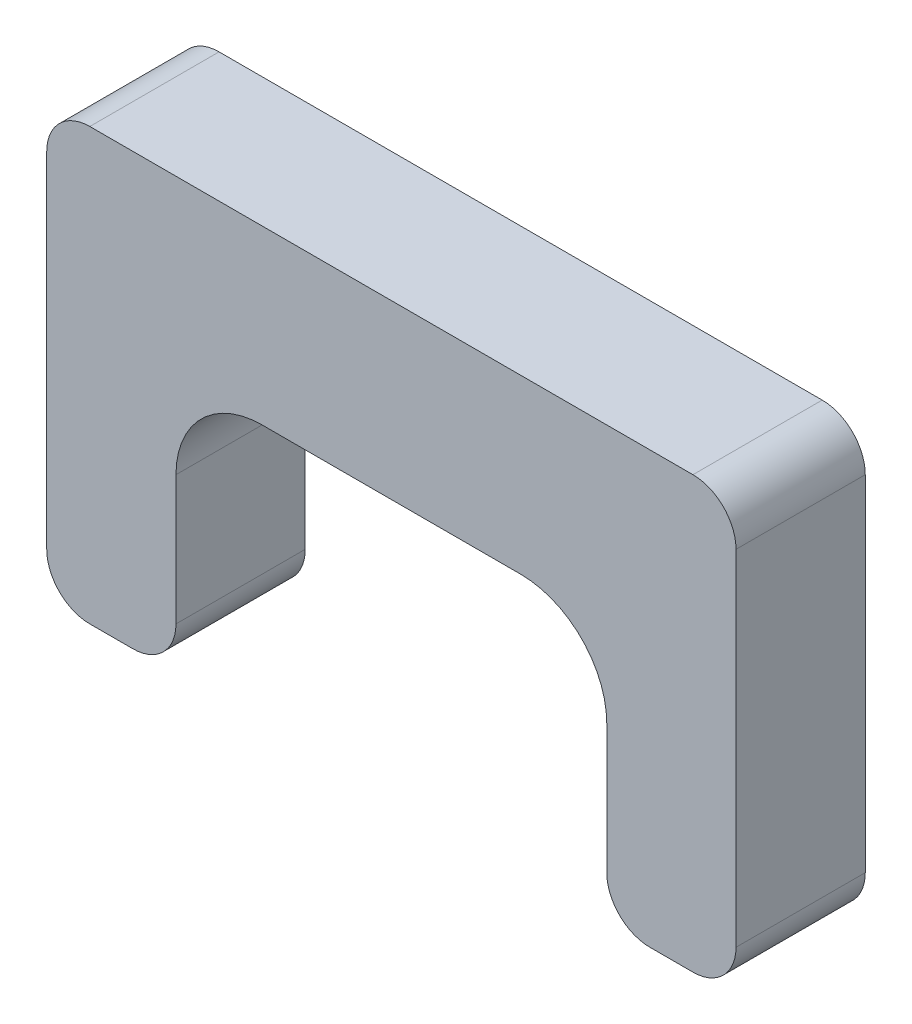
from build123d import *

# Parameters (mm, degrees)
SKETCH_1_W          = 16
SKETCH_1_H          = 10
EXTRUDE_1_DEPTH     = 3
SKETCH_2_W          = 10
SKETCH_2_H          = 12
CUT_EXTRUDE_1_DEPTH = 3
FILLET_1_R          = 2
FILLET_2_R          = 1


with BuildPart() as part:
    # Sketch 1 → Extrude 1 (new body)
    with BuildSketch(Plane.XY):
        Rectangle(SKETCH_1_W, SKETCH_1_H)
    extrude(amount=EXTRUDE_1_DEPTH)

    # Sketch 2 → Cut-Extrude 1 (cut)
    with BuildSketch(Plane.XY.offset(3)):
        with Locations((0, -5)):
            Rectangle(SKETCH_2_W, SKETCH_2_H)
    extrude(amount=-CUT_EXTRUDE_1_DEPTH, mode=Mode.SUBTRACT)

    # Fillet 1
    fillet_1_edges = [part.edges().sort_by_distance(p)[0] for p in [
        (5, 1, 1.5),
        (-5, 1, 1.5),
    ]]
    fillet(fillet_1_edges, radius=FILLET_1_R)

    # Fillet 2
    fillet_2_edges = [part.edges().sort_by_distance(p)[0] for p in [
        (5, -5, 1.5),
        (-5, -5, 1.5),
        (8, -5, 1.5),
        (-8, -5, 1.5),
        (-8, 5, 1.5),
        (8, 5, 1.5),
    ]]
    fillet(fillet_2_edges, radius=FILLET_2_R)


solid = part.part
